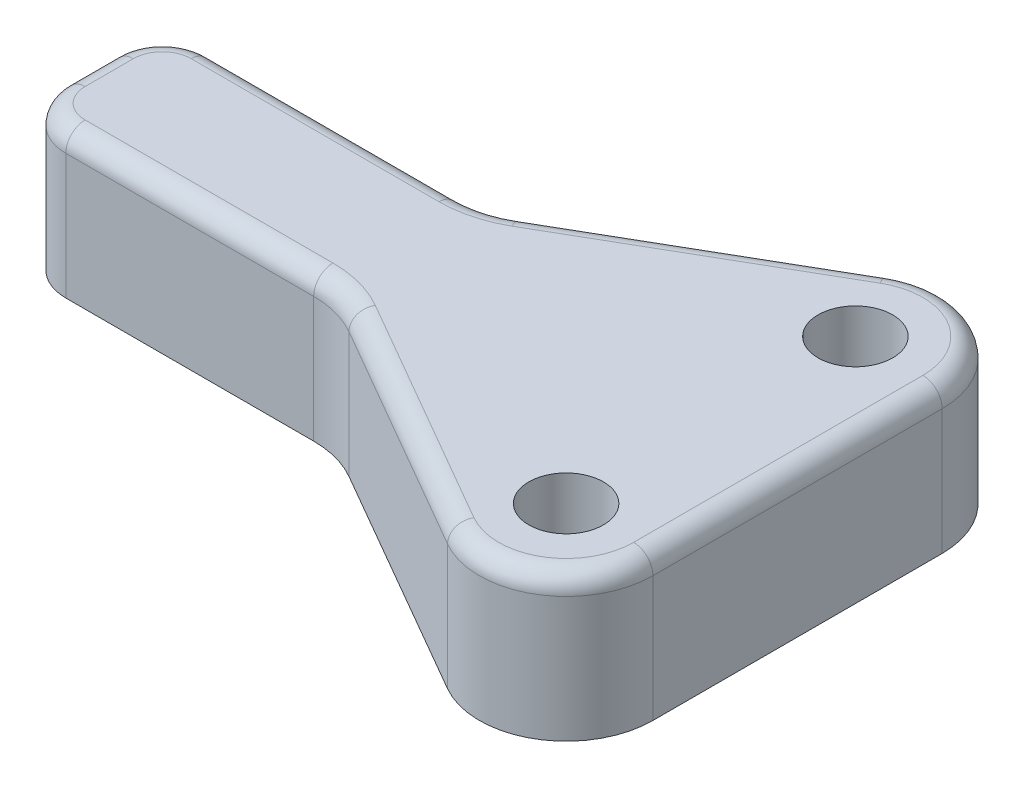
from build123d import *

# Parameters (mm, degrees)
BOSS_EXTRUDE1_DEPTH          = 9.525
F_10_0_1935_DIAMETER_HOLE1_D = 4.9149
F_4_40_TAPPED_HOLE1_D        = 2.2606
F_4_40_TAPPED_HOLE1_DEPTH    = 12.7
F_4_40_TAPPED_HOLE1_TIP      = 0.679152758
FILLET1_R                    = 1.27


with BuildPart() as part:
    # Sketch1 → Boss-Extrude1 (new body)
    with BuildSketch(Plane(origin=(0, 0, 0), x_dir=(1, 0, 0), z_dir=(0, 1, 0))):
        with BuildLine():
            Line((-0.244868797, -1.5875), (-0.244868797, 1.5875))
            ThreePointArc((-0.244868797, 1.5875), (0.685067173, 3.83256403), (2.930131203, 4.7625))
            Line((2.930131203, 4.7625), (19.251034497, 4.7625))
            ThreePointArc((19.251034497, 4.7625), (20.894053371, 4.978741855), (22.425170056, 5.612739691))
            Line((22.425170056, 5.612739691), (37.780254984, 14.474784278))
            ThreePointArc((37.780254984, 14.474784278), (43.494865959, 14.474110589), (46.351976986, 9.525))
            Line((46.351976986, 9.525), (46.351976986, -9.525))
            ThreePointArc((46.351976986, -9.525), (43.494865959, -14.474110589), (37.780254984, -14.474784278))
            Line((37.780254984, -14.474784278), (22.425170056, -5.612739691))
            ThreePointArc((22.425170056, -5.612739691), (20.894053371, -4.978741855), (19.251034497, -4.7625))
            Line((19.251034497, -4.7625), (2.930131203, -4.7625))
            ThreePointArc((2.930131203, -4.7625), (0.685067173, -3.83256403), (-0.244868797, -1.5875))
        make_face()
    extrude(amount=-BOSS_EXTRUDE1_DEPTH)

    # 10 _0.1935_ Diameter Hole1 (through all)
    with Locations(Plane(origin=(0, 0, 0), x_dir=(1, 0, 0), z_dir=(0, 1, 0))):
        with Locations((40.636976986, -9.525), (40.636976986, 9.525)):
            Hole(F_10_0_1935_DIAMETER_HOLE1_D / 2)

    # 4-40 Tapped Hole1
    with Locations(Plane.ZY.offset(0.244868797)):
        with Locations((0, -6.985)):
            Hole(F_4_40_TAPPED_HOLE1_D / 2, depth=F_4_40_TAPPED_HOLE1_DEPTH)
            with Locations((0, 0, -(F_4_40_TAPPED_HOLE1_DEPTH + F_4_40_TAPPED_HOLE1_TIP / 2))):  # 118° drill point
                Cone(0, F_4_40_TAPPED_HOLE1_D / 2, F_4_40_TAPPED_HOLE1_TIP, mode=Mode.SUBTRACT)

    # Fillet1
    fillet1_edges = [part.edges().sort_by_distance(p)[0] for p in [
        (30.10271252, 0, 10.043761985),
        (20.894053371, 0, 4.978741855),
        (11.09058285, 0, 4.7625),
        (0.685067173, 0, 3.83256403),
        (-0.244868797, 0, 0),
        (0.685067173, 0, -3.83256403),
        (11.09058285, 0, -4.7625),
        (20.894053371, 0, -4.978741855),
        (30.10271252, 0, -10.043761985),
        (43.494865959, 0, -14.474110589),
        (46.351976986, 0, 0),
        (43.494865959, 0, 14.474110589),
    ]]
    fillet(fillet1_edges, radius=FILLET1_R)


solid = part.part
